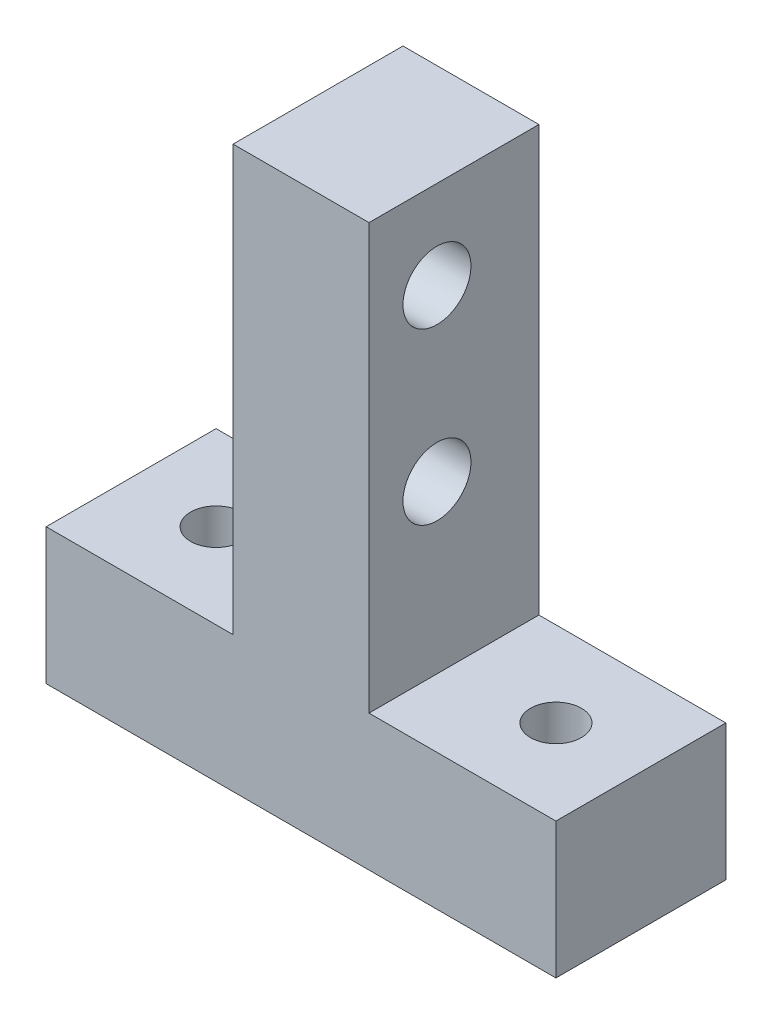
from build123d import *

# Parameters (mm, degrees)
SKETCH1_W           = 30
SKETCH1_H           = 10
BOSS_EXTRUDE1_DEPTH = 8
SKETCH2_W           = 8
SKETCH2_H           = 10
BOSS_EXTRUDE2_DEPTH = 25
CUT_EXTRUDE1_REACH  = 31.58
SKETCH3_R           = 1.5
CUT_EXTRUDE2_REACH  = 40.406
SKETCH4_R           = 2


with BuildPart() as part:
    # Sketch1 → Boss-Extrude1 (new body)
    with BuildSketch(Plane(origin=(0, 0, 0), x_dir=(1, 0, 0), z_dir=(0, 1, 0))):
        Rectangle(SKETCH1_W, SKETCH1_H)
    extrude(amount=BOSS_EXTRUDE1_DEPTH)

    # Sketch2 → Boss-Extrude2 (add)
    with BuildSketch(Plane(origin=(0, 8, 0), x_dir=(1, 0, 0), z_dir=(0, 1, 0))):
        Rectangle(SKETCH2_W, SKETCH2_H)
    extrude(amount=BOSS_EXTRUDE2_DEPTH)

    # Sketch3 → Cut-Extrude1 (cut, up to next)
    with BuildSketch(Plane(origin=(0, 8, 0), x_dir=(1, 0, 0), z_dir=(0, 1, 0)), mode=Mode.PRIVATE) as cut_extrude1_sk1:
        with Locations(Location((10, 0, 0), (0, 0, 270))):
            Circle(SKETCH3_R)
    cut_extrude1_tool1 = extrude(cut_extrude1_sk1.sketch, amount=-CUT_EXTRUDE1_REACH, mode=Mode.PRIVATE) & part.part
    # Sketch3 → Cut-Extrude1 (cut, up to next)
    with BuildSketch(Plane(origin=(0, 8, 0), x_dir=(1, 0, 0), z_dir=(0, 1, 0)), mode=Mode.PRIVATE) as cut_extrude1_sk2:
        with Locations(Location((-10, 0, 0), (0, 0, 270))):
            Circle(SKETCH3_R)
    cut_extrude1_tool2 = extrude(cut_extrude1_sk2.sketch, amount=-CUT_EXTRUDE1_REACH, mode=Mode.PRIVATE) & part.part
    add(cut_extrude1_tool1.solids().sort_by_distance((10, 8, 0))[0], mode=Mode.SUBTRACT)
    add(cut_extrude1_tool2.solids().sort_by_distance((-10, 8, 0))[0], mode=Mode.SUBTRACT)

    # Sketch4 → Cut-Extrude2 (cut, up to next)
    with BuildSketch(Plane.ZY.offset(4), mode=Mode.PRIVATE) as cut_extrude2_sk1:
        with Locations((1, 27.8)):
            Circle(SKETCH4_R)
    cut_extrude2_tool1 = extrude(cut_extrude2_sk1.sketch, amount=-CUT_EXTRUDE2_REACH, mode=Mode.PRIVATE) & part.part
    # Sketch4 → Cut-Extrude2 (cut, up to next)
    with BuildSketch(Plane.ZY.offset(4), mode=Mode.PRIVATE) as cut_extrude2_sk2:
        with Locations((1, 17.8)):
            Circle(SKETCH4_R)
    cut_extrude2_tool2 = extrude(cut_extrude2_sk2.sketch, amount=-CUT_EXTRUDE2_REACH, mode=Mode.PRIVATE) & part.part
    add(cut_extrude2_tool1.solids().sort_by_distance((-4, 27.8, 1))[0], mode=Mode.SUBTRACT)
    add(cut_extrude2_tool2.solids().sort_by_distance((-4, 17.8, 1))[0], mode=Mode.SUBTRACT)


solid = part.part
